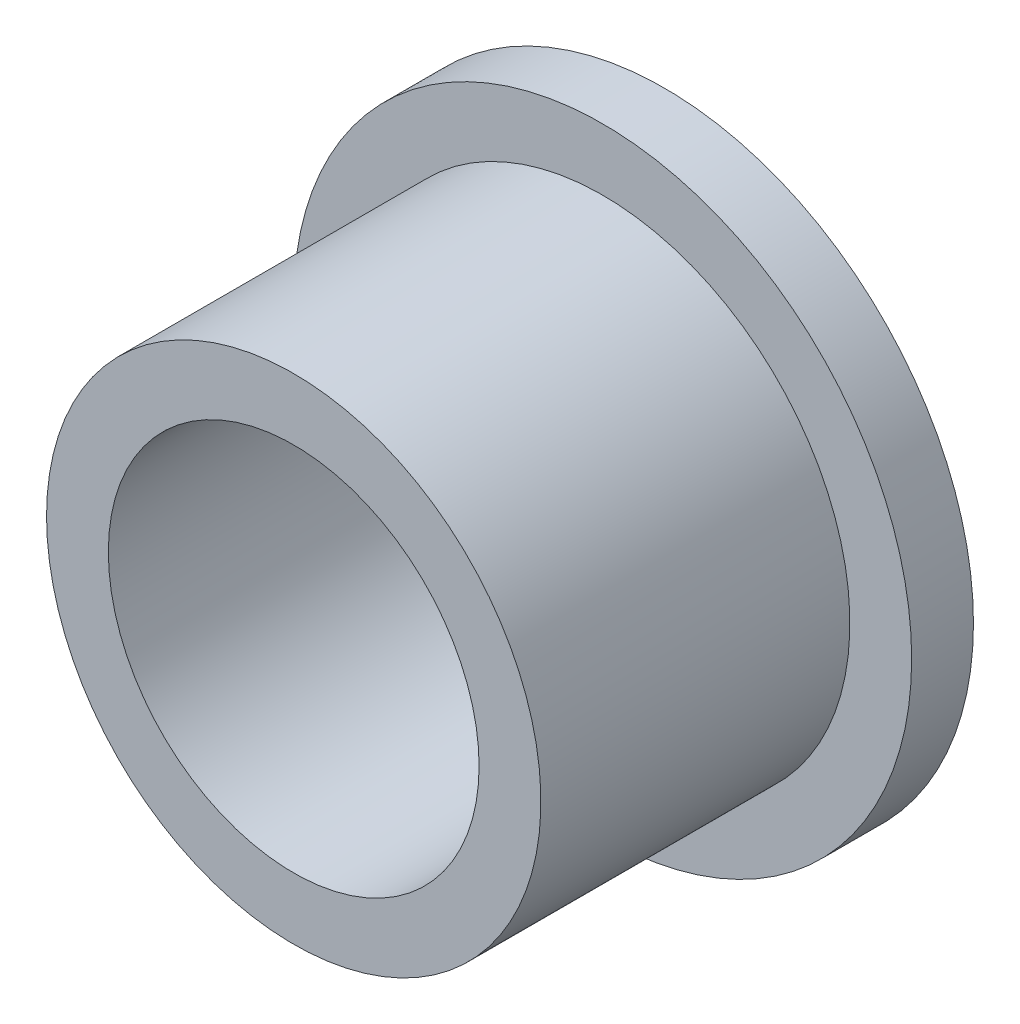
from build123d import *

# Parameters (mm, degrees)
SKETCH1_R           = 7.9375
SKETCH1_R_2         = 6.35
SKETCH1_R_3         = 4.7625
BOSS_EXTRUDE1_DEPTH = 1.5875
SKETCH1_3_R         = 6.35
SKETCH1_3_R_2       = 4.7625
BOSS_EXTRUDE2_DEPTH = 9.525


with BuildPart() as part:
    # Sketch1 → Boss-Extrude1 (new body)
    # profile 1 of 2: a face of its own
    with BuildSketch(Plane.XY):
        Circle(SKETCH1_R)
        Circle(SKETCH1_R_2, mode=Mode.SUBTRACT)
    # profile 2 of 2: a face of its own
    with BuildSketch(Plane.XY):
        Circle(SKETCH1_R_2)
        Circle(SKETCH1_R_3, mode=Mode.SUBTRACT)
    extrude(amount=BOSS_EXTRUDE1_DEPTH)

    # Sketch1_3 → Boss-Extrude2 (add)
    with BuildSketch(Plane.XY):
        with Locations(Location((0, 0, 0), (0, 0, 180))):
            Circle(SKETCH1_3_R)
        Circle(SKETCH1_3_R_2, mode=Mode.SUBTRACT)
    extrude(amount=BOSS_EXTRUDE2_DEPTH)


solid = part.part
